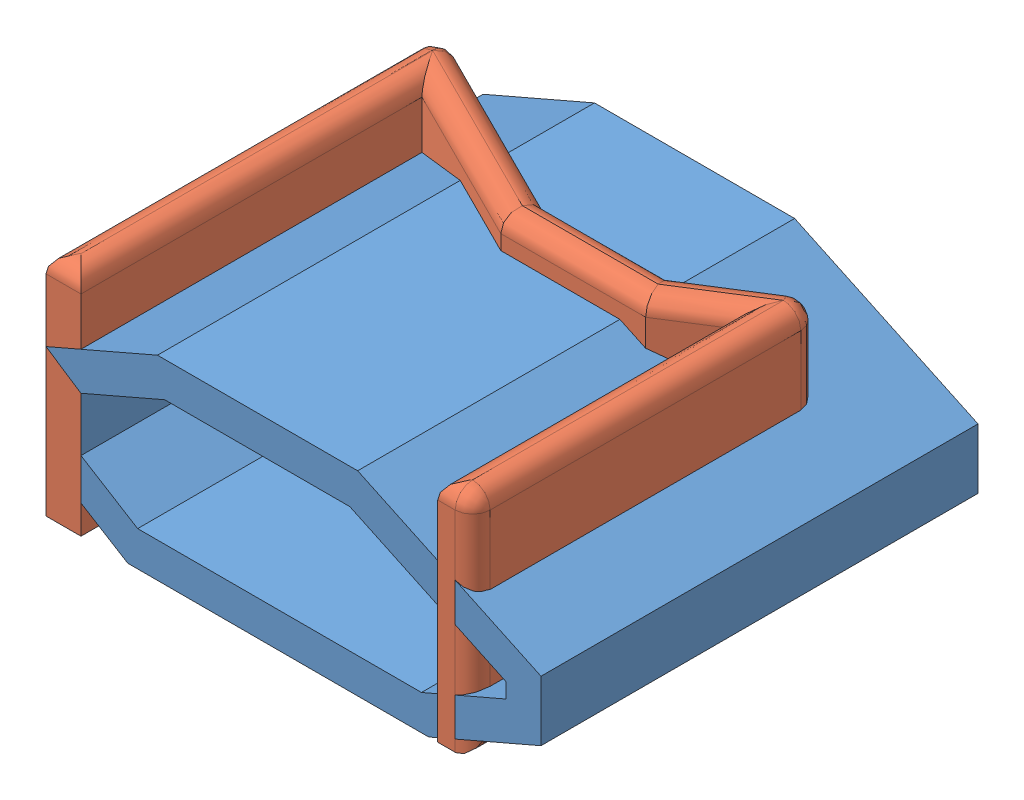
SolidWorks assembly Assem1.sldasm, configuration Default (file format 6000). Lengths in mm.
Overall size (283.17 130 250).
2 component instances, 2 part files, 3 mates.
Components (placement in the parent):
- Multibody 1-1: Multibody 1.SLDPRT [Default] at origin size (283.17 111.58 250)
- Multibody Part 2-1: Multibody Part 2.SLDPRT [Default] at (164.8993 -34.3755 -50.7575) x (0 0 -1) z (1 0 0) size (221.24 130 244.07)
Mates (geometry in assembly coordinates):
- Coincident1: coincident aligned: plane of Multibody 1-1 through (0 0 125) normal (0 0 1); plane of Multibody Part 2-1 through (10 95.6245 125) normal (0 0 1)
- Coincident2: coincident aligned: line of Multibody 1-1 through (-10 49.5985 125) axis (0 -1 0); line of Multibody Part 2-1 through (-10 85.6245 125) axis (0 -1 0)
- Coincident3: coincident aligned: plane of Multibody 1-1 through (0 -34.3755 125) normal (0 -1 0); plane of Multibody Part 2-1 through (164.8993 -34.3755 -50.7575) normal (0 -1 0)
